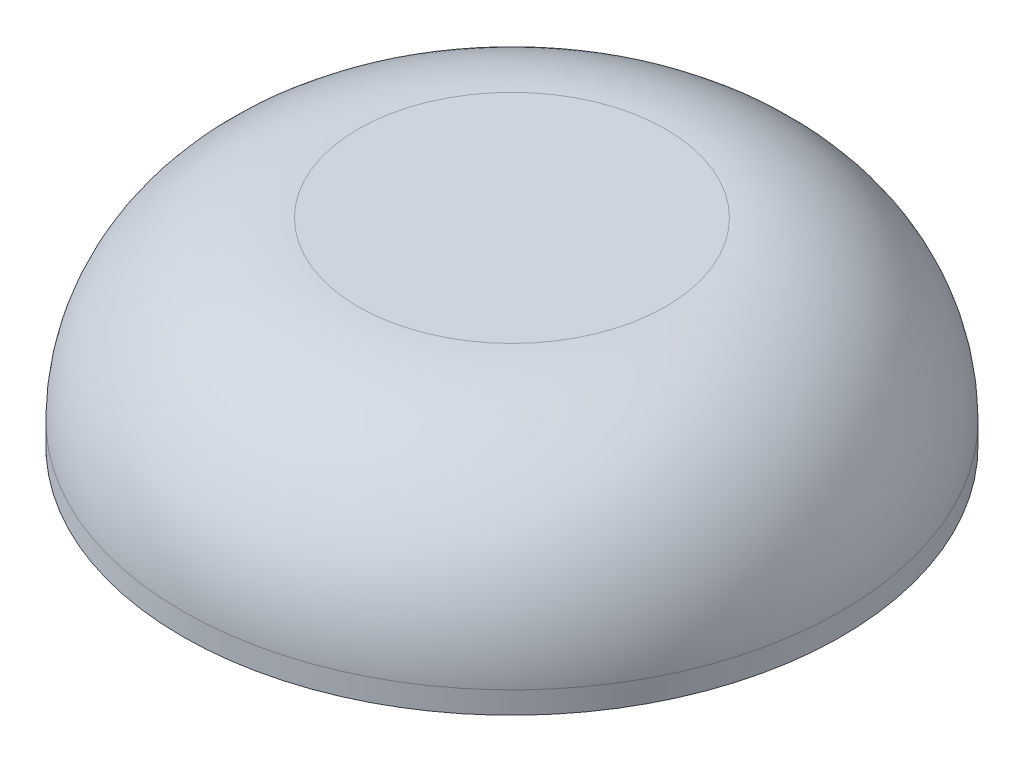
from build123d import *

# Parameters (mm, degrees)
ESQUISSE1_R      = 7.5
EXTRUSION1_DEPTH = 4.5
CONG_1_R         = 4


with BuildPart() as part:
    # Esquisse1 → Extrusion1 (new body)
    with BuildSketch(Plane(origin=(0, 0, 0), x_dir=(1, 0, 0), z_dir=(0, 1, 0))):
        with Locations(Location((0, 0, 0), (0, 0, 270))):
            Circle(ESQUISSE1_R)
    extrude(amount=EXTRUSION1_DEPTH)

    # Cong_1
    cong_1_edges = [part.edges().sort_by_distance(p)[0] for p in [
        (0, 4.5, -7.5),
    ]]
    fillet(cong_1_edges, radius=CONG_1_R)


solid = part.part
